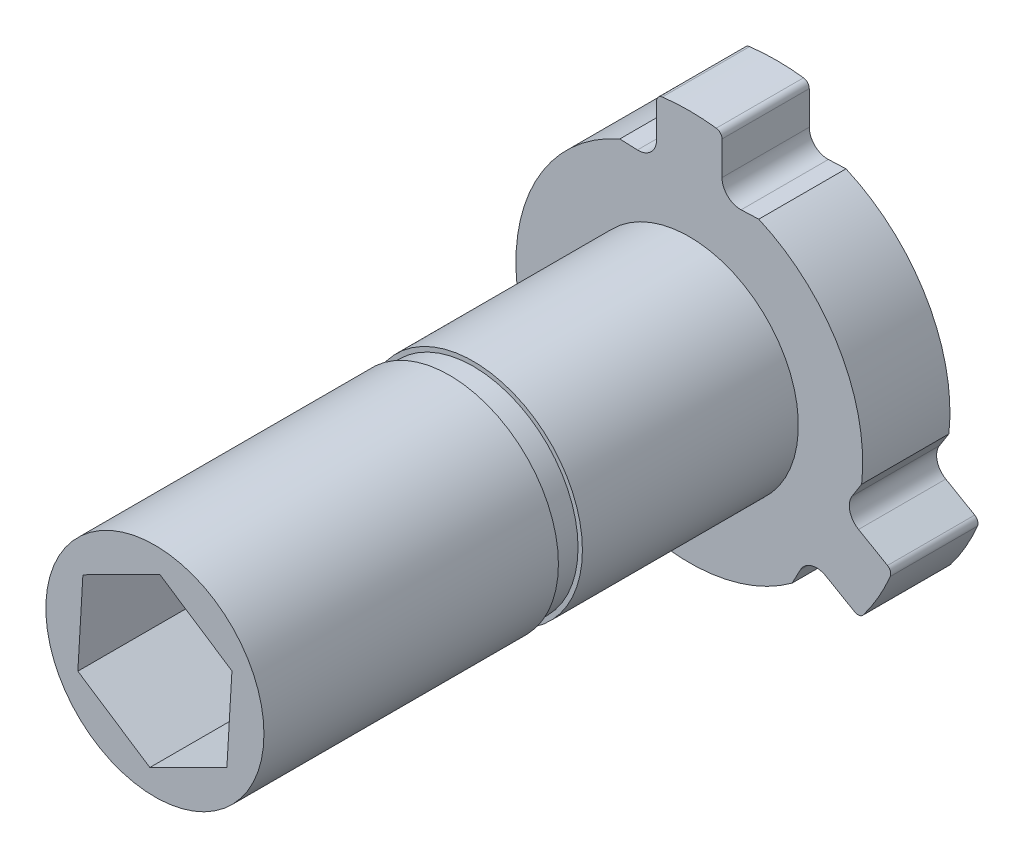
ISO-10303-21;
HEADER;
FILE_DESCRIPTION(('STEP AP214'),'2;1');
FILE_NAME('part.step','',(''),(''),'','','');
FILE_SCHEMA(('AUTOMOTIVE_DESIGN { 1 0 10303 214 1 1 1 1 }'));
ENDSEC;
DATA;
#1=APPLICATION_CONTEXT('core data for automotive mechanical design processes');
#2=APPLICATION_PROTOCOL_DEFINITION('international standard','automotive_design',2000,#1);
#3=PRODUCT_CONTEXT('',#1,'mechanical');
#4=PRODUCT('Part','Part','',(#3));
#5=PRODUCT_RELATED_PRODUCT_CATEGORY('part','',(#4));
#6=PRODUCT_DEFINITION_FORMATION('','',#4);
#7=PRODUCT_DEFINITION_CONTEXT('part definition',#1,'design');
#8=PRODUCT_DEFINITION('design','',#6,#7);
#9=PRODUCT_DEFINITION_SHAPE('','',#8);
#10=(LENGTH_UNIT() NAMED_UNIT(*) SI_UNIT(.MILLI.,.METRE.));
#11=(NAMED_UNIT(*) PLANE_ANGLE_UNIT() SI_UNIT($,.RADIAN.));
#12=(NAMED_UNIT(*) SI_UNIT($,.STERADIAN.) SOLID_ANGLE_UNIT());
#13=UNCERTAINTY_MEASURE_WITH_UNIT(LENGTH_MEASURE(1.E-05),#10,'distance_accuracy_value','');
#14=(GEOMETRIC_REPRESENTATION_CONTEXT(3) GLOBAL_UNCERTAINTY_ASSIGNED_CONTEXT((#13)) GLOBAL_UNIT_ASSIGNED_CONTEXT((#10,
#11,#12)) REPRESENTATION_CONTEXT('',''));
#15=CARTESIAN_POINT('',(0.,0.,0.));
#16=DIRECTION('',(0.,0.,1.));
#17=DIRECTION('',(1.,0.,0.));
#18=AXIS2_PLACEMENT_3D('',#15,#16,#17);
#19=CARTESIAN_POINT('',(0.,0.,24.5));
#20=DIRECTION('',(0.,0.,-1.));
#21=DIRECTION('',(-1.,0.,0.));
#22=AXIS2_PLACEMENT_3D('',#19,#20,#21);
#23=CYLINDRICAL_SURFACE('',#22,5.);
#24=CARTESIAN_POINT('',(0.,0.,0.));
#25=DIRECTION('',(0.,0.,-1.));
#26=DIRECTION('',(-1.,0.,0.));
#27=AXIS2_PLACEMENT_3D('',#24,#25,#26);
#28=CIRCLE('',#27,5.);
#29=CARTESIAN_POINT('',(-5.,0.,0.));
#30=VERTEX_POINT('',#29);
#31=EDGE_CURVE('E520',#30,#30,#28,.T.);
#32=ORIENTED_EDGE('',*,*,#31,.F.);
#33=EDGE_LOOP('',(#32));
#34=FACE_BOUND('',#33,.T.);
#35=CARTESIAN_POINT('',(0.,0.,9.9));
#36=DIRECTION('',(0.,0.,1.));
#37=DIRECTION('',(1.,0.,0.));
#38=AXIS2_PLACEMENT_3D('',#35,#36,#37);
#39=CIRCLE('',#38,5.);
#40=CARTESIAN_POINT('',(5.,0.,9.9));
#41=VERTEX_POINT('',#40);
#42=EDGE_CURVE('E715',#41,#41,#39,.T.);
#43=ORIENTED_EDGE('',*,*,#42,.F.);
#44=EDGE_LOOP('',(#43));
#45=FACE_BOUND('',#44,.T.);
#46=ADVANCED_FACE('F117',(#34,#45),#23,.T.);
#47=CARTESIAN_POINT('',(0.,0.,0.));
#48=DIRECTION('',(0.,0.,-1.));
#49=DIRECTION('',(-1.,0.,0.));
#50=AXIS2_PLACEMENT_3D('',#47,#48,#49);
#51=PLANE('',#50);
#52=ORIENTED_EDGE('',*,*,#31,.T.);
#53=EDGE_LOOP('',(#52));
#54=FACE_BOUND('',#53,.T.);
#55=CARTESIAN_POINT('',(0.,0.,0.));
#56=DIRECTION('',(0.,0.,-1.));
#57=DIRECTION('',(-1.,0.,0.));
#58=AXIS2_PLACEMENT_3D('',#55,#56,#57);
#59=CIRCLE('',#58,10.);
#60=CARTESIAN_POINT('',(9.21228481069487,-3.89021960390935,0.));
#61=VERTEX_POINT('',#60);
#62=CARTESIAN_POINT('',(7.97517140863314,-6.03296287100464,0.));
#63=VERTEX_POINT('',#62);
#64=EDGE_CURVE('E515',#61,#63,#59,.T.);
#65=ORIENTED_EDGE('',*,*,#64,.F.);
#66=CARTESIAN_POINT('',(8.93591626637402,-3.77351301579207,0.));
#67=DIRECTION('',(0.,0.,-1.));
#68=DIRECTION('',(-1.,0.,0.));
#69=AXIS2_PLACEMENT_3D('',#66,#67,#68);
#70=CIRCLE('',#69,0.3);
#71=CARTESIAN_POINT('',(9.08591626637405,-3.51370539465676,0.));
#72=VERTEX_POINT('',#71);
#73=EDGE_CURVE('E605',#61,#72,#70,.F.);
#74=ORIENTED_EDGE('',*,*,#73,.T.);
#75=DIRECTION('',(-0.866025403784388,0.500000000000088,0.));
#76=VECTOR('',#75,1.);
#77=CARTESIAN_POINT('',(0.750000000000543,1.29903810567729,0.));
#78=LINE('',#77,#76);
#79=CARTESIAN_POINT('',(7.75882819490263,-2.74751073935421,0.));
#80=VERTEX_POINT('',#79);
#81=EDGE_CURVE('E504',#72,#80,#78,.T.);
#82=ORIENTED_EDGE('',*,*,#81,.T.);
#83=CARTESIAN_POINT('',(8.18007630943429,-2.01788760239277,0.));
#84=DIRECTION('',(0.,0.,-1.));
#85=DIRECTION('',(-1.,0.,0.));
#86=AXIS2_PLACEMENT_3D('',#83,#84,#85);
#87=CIRCLE('',#86,0.842496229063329);
#88=CARTESIAN_POINT('',(7.46810034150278,-1.56745434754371,0.));
#89=VERTEX_POINT('',#88);
#90=EDGE_CURVE('E501',#80,#89,#87,.T.);
#91=ORIENTED_EDGE('',*,*,#90,.T.);
#92=DIRECTION('',(0.53464127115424,0.845079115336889,0.));
#93=VECTOR('',#92,1.);
#94=CARTESIAN_POINT('',(6.04160700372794,-3.8222367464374,0.));
#95=LINE('',#94,#93);
#96=CARTESIAN_POINT('',(7.90074398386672,-0.883597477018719,0.));
#97=VERTEX_POINT('',#96);
#98=EDGE_CURVE('E498',#89,#97,#95,.T.);
#99=ORIENTED_EDGE('',*,*,#98,.T.);
#100=CARTESIAN_POINT('',(0.,0.,0.));
#101=DIRECTION('',(0.,0.,-1.));
#102=DIRECTION('',(-1.,0.,0.));
#103=AXIS2_PLACEMENT_3D('',#100,#101,#102);
#104=CIRCLE('',#103,7.95);
#105=CARTESIAN_POINT('',(3.18515413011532,7.28404373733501,0.));
#106=VERTEX_POINT('',#105);
#107=EDGE_CURVE('E496',#106,#97,#104,.T.);
#108=ORIENTED_EDGE('',*,*,#107,.F.);
#109=DIRECTION('',(0.999180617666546,0.0404733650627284,0.));
#110=VECTOR('',#109,1.);
#111=CARTESIAN_POINT('',(-0.289350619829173,7.1433035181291,0.));
#112=LINE('',#111,#110);
#113=CARTESIAN_POINT('',(2.37659488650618,7.25129178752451,0.));
#114=VERTEX_POINT('',#113);
#115=EDGE_CURVE('E494',#114,#106,#112,.T.);
#116=ORIENTED_EDGE('',*,*,#115,.F.);
#117=CARTESIAN_POINT('',(2.34249622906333,8.09309769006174,0.));
#118=DIRECTION('',(0.,0.,-1.));
#119=DIRECTION('',(-1.,0.,0.));
#120=AXIS2_PLACEMENT_3D('',#117,#118,#119);
#121=CIRCLE('',#120,0.842496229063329);
#122=CARTESIAN_POINT('',(1.5,8.09309769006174,0.));
#123=VERTEX_POINT('',#122);
#124=EDGE_CURVE('E492',#123,#114,#121,.F.);
#125=ORIENTED_EDGE('',*,*,#124,.F.);
#126=DIRECTION('',(0.,-1.,0.));
#127=VECTOR('',#126,1.);
#128=CARTESIAN_POINT('',(1.5,0.,0.));
#129=LINE('',#128,#127);
#130=CARTESIAN_POINT('',(1.5,9.62548700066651,0.));
#131=VERTEX_POINT('',#130);
#132=EDGE_CURVE('E490',#131,#123,#129,.T.);
#133=ORIENTED_EDGE('',*,*,#132,.F.);
#134=CARTESIAN_POINT('',(1.2,9.62548700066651,0.));
#135=DIRECTION('',(0.,0.,-1.));
#136=DIRECTION('',(-1.,0.,0.));
#137=AXIS2_PLACEMENT_3D('',#134,#135,#136);
#138=CIRCLE('',#137,0.3);
#139=CARTESIAN_POINT('',(1.23711340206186,9.92318247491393,0.));
#140=VERTEX_POINT('',#139);
#141=EDGE_CURVE('E598',#131,#140,#138,.F.);
#142=ORIENTED_EDGE('',*,*,#141,.T.);
#143=CARTESIAN_POINT('',(-1.23711340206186,9.92318247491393,0.));
#144=VERTEX_POINT('',#143);
#145=EDGE_CURVE('E516',#144,#140,#59,.T.);
#146=ORIENTED_EDGE('',*,*,#145,.F.);
#147=CARTESIAN_POINT('',(-1.2,9.62548700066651,0.));
#148=DIRECTION('',(0.,0.,-1.));
#149=DIRECTION('',(-1.,0.,0.));
#150=AXIS2_PLACEMENT_3D('',#147,#148,#149);
#151=CIRCLE('',#150,0.3);
#152=CARTESIAN_POINT('',(-1.5,9.62548700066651,0.));
#153=VERTEX_POINT('',#152);
#154=EDGE_CURVE('E596',#144,#153,#151,.F.);
#155=ORIENTED_EDGE('',*,*,#154,.T.);
#156=DIRECTION('',(0.,-1.,0.));
#157=VECTOR('',#156,1.);
#158=CARTESIAN_POINT('',(-1.5,0.,0.));
#159=LINE('',#158,#157);
#160=CARTESIAN_POINT('',(-1.5,8.09309769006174,0.));
#161=VERTEX_POINT('',#160);
#162=EDGE_CURVE('E488',#153,#161,#159,.T.);
#163=ORIENTED_EDGE('',*,*,#162,.T.);
#164=CARTESIAN_POINT('',(-2.34249622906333,8.09309769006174,0.));
#165=DIRECTION('',(0.,0.,-1.));
#166=DIRECTION('',(-1.,0.,0.));
#167=AXIS2_PLACEMENT_3D('',#164,#165,#166);
#168=CIRCLE('',#167,0.842496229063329);
#169=CARTESIAN_POINT('',(-2.37659488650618,7.25129178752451,0.));
#170=VERTEX_POINT('',#169);
#171=EDGE_CURVE('E485',#161,#170,#168,.T.);
#172=ORIENTED_EDGE('',*,*,#171,.T.);
#173=DIRECTION('',(-0.999180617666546,0.0404733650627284,0.));
#174=VECTOR('',#173,1.);
#175=CARTESIAN_POINT('',(0.289350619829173,7.1433035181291,0.));
#176=LINE('',#175,#174);
#177=CARTESIAN_POINT('',(-3.18515413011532,7.28404373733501,0.));
#178=VERTEX_POINT('',#177);
#179=EDGE_CURVE('E482',#170,#178,#176,.T.);
#180=ORIENTED_EDGE('',*,*,#179,.T.);
#181=CARTESIAN_POINT('',(0.,0.,0.));
#182=DIRECTION('',(0.,0.,-1.));
#183=DIRECTION('',(-1.,0.,0.));
#184=AXIS2_PLACEMENT_3D('',#181,#182,#183);
#185=CIRCLE('',#184,7.95);
#186=CARTESIAN_POINT('',(-7.90074398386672,-0.883597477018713,0.));
#187=VERTEX_POINT('',#186);
#188=EDGE_CURVE('E480',#187,#178,#185,.T.);
#189=ORIENTED_EDGE('',*,*,#188,.F.);
#190=DIRECTION('',(-0.534641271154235,0.845079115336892,0.));
#191=VECTOR('',#190,1.);
#192=CARTESIAN_POINT('',(-6.04160700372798,-3.82223674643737,0.));
#193=LINE('',#192,#191);
#194=CARTESIAN_POINT('',(-7.46810034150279,-1.5674543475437,0.));
#195=VERTEX_POINT('',#194);
#196=EDGE_CURVE('E478',#195,#187,#193,.T.);
#197=ORIENTED_EDGE('',*,*,#196,.F.);
#198=CARTESIAN_POINT('',(-8.18007630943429,-2.01788760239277,0.));
#199=DIRECTION('',(0.,0.,-1.));
#200=DIRECTION('',(-1.,0.,0.));
#201=AXIS2_PLACEMENT_3D('',#198,#199,#200);
#202=CIRCLE('',#201,0.842496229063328);
#203=CARTESIAN_POINT('',(-7.75882819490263,-2.74751073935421,0.));
#204=VERTEX_POINT('',#203);
#205=EDGE_CURVE('E476',#204,#195,#202,.F.);
#206=ORIENTED_EDGE('',*,*,#205,.F.);
#207=DIRECTION('',(0.866025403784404,0.50000000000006,0.));
#208=VECTOR('',#207,1.);
#209=CARTESIAN_POINT('',(-0.750000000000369,1.29903810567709,0.));
#210=LINE('',#209,#208);
#211=CARTESIAN_POINT('',(-9.08591626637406,-3.51370539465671,0.));
#212=VERTEX_POINT('',#211);
#213=EDGE_CURVE('E474',#212,#204,#210,.T.);
#214=ORIENTED_EDGE('',*,*,#213,.F.);
#215=CARTESIAN_POINT('',(-8.93591626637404,-3.77351301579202,0.));
#216=DIRECTION('',(0.,0.,-1.));
#217=DIRECTION('',(-1.,0.,0.));
#218=AXIS2_PLACEMENT_3D('',#215,#216,#217);
#219=CIRCLE('',#218,0.3);
#220=CARTESIAN_POINT('',(-9.21228481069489,-3.8902196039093,0.));
#221=VERTEX_POINT('',#220);
#222=EDGE_CURVE('E603',#212,#221,#219,.F.);
#223=ORIENTED_EDGE('',*,*,#222,.T.);
#224=CARTESIAN_POINT('',(-7.97517140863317,-6.0329628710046,0.));
#225=VERTEX_POINT('',#224);
#226=EDGE_CURVE('E512',#225,#221,#59,.T.);
#227=ORIENTED_EDGE('',*,*,#226,.F.);
#228=CARTESIAN_POINT('',(-7.73591626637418,-5.85197398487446,0.));
#229=DIRECTION('',(0.,0.,-1.));
#230=DIRECTION('',(-1.,0.,0.));
#231=AXIS2_PLACEMENT_3D('',#228,#229,#230);
#232=CIRCLE('',#231,0.3);
#233=CARTESIAN_POINT('',(-7.58591626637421,-6.1117816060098,0.));
#234=VERTEX_POINT('',#233);
#235=EDGE_CURVE('E140',#225,#234,#232,.F.);
#236=ORIENTED_EDGE('',*,*,#235,.T.);
#237=DIRECTION('',(0.866025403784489,0.499999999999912,0.));
#238=VECTOR('',#237,1.);
#239=CARTESIAN_POINT('',(0.750000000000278,-1.29903810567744,0.));
#240=LINE('',#239,#238);
#241=CARTESIAN_POINT('',(-6.25882819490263,-5.34558695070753,0.));
#242=VERTEX_POINT('',#241);
#243=EDGE_CURVE('E472',#234,#242,#240,.T.);
#244=ORIENTED_EDGE('',*,*,#243,.T.);
#245=CARTESIAN_POINT('',(-5.83758008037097,-6.07521008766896,0.));
#246=DIRECTION('',(0.,0.,-1.));
#247=DIRECTION('',(-1.,0.,0.));
#248=AXIS2_PLACEMENT_3D('',#245,#246,#247);
#249=CIRCLE('',#248,0.842496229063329);
#250=CARTESIAN_POINT('',(-5.09150545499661,-5.68383743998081,0.));
#251=VERTEX_POINT('',#250);
#252=EDGE_CURVE('E470',#242,#251,#249,.T.);
#253=ORIENTED_EDGE('',*,*,#252,.T.);
#254=DIRECTION('',(0.464539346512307,-0.88555248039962,0.));
#255=VECTOR('',#254,1.);
#256=CARTESIAN_POINT('',(-6.33095762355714,-3.3210667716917,0.));
#257=LINE('',#256,#255);
#258=CARTESIAN_POINT('',(-4.71558985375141,-6.4004462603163,0.));
#259=VERTEX_POINT('',#258);
#260=EDGE_CURVE('E359',#251,#259,#257,.T.);
#261=ORIENTED_EDGE('',*,*,#260,.T.);
#262=CARTESIAN_POINT('',(0.,0.,0.));
#263=DIRECTION('',(0.,0.,-1.));
#264=DIRECTION('',(-1.,0.,0.));
#265=AXIS2_PLACEMENT_3D('',#262,#263,#264);
#266=CIRCLE('',#265,7.95);
#267=CARTESIAN_POINT('',(4.7155898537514,-6.40044626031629,0.));
#268=VERTEX_POINT('',#267);
#269=EDGE_CURVE('E433',#268,#259,#266,.T.);
#270=ORIENTED_EDGE('',*,*,#269,.F.);
#271=DIRECTION('',(-0.464539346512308,-0.885552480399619,0.));
#272=VECTOR('',#271,1.);
#273=CARTESIAN_POINT('',(6.33095762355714,-3.32106677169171,0.));
#274=LINE('',#273,#272);
#275=CARTESIAN_POINT('',(5.0915054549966,-5.68383743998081,0.));
#276=VERTEX_POINT('',#275);
#277=EDGE_CURVE('E510',#276,#268,#274,.T.);
#278=ORIENTED_EDGE('',*,*,#277,.F.);
#279=CARTESIAN_POINT('',(5.83758008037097,-6.07521008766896,0.));
#280=DIRECTION('',(0.,0.,-1.));
#281=DIRECTION('',(-1.,0.,0.));
#282=AXIS2_PLACEMENT_3D('',#279,#280,#281);
#283=CIRCLE('',#282,0.842496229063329);
#284=CARTESIAN_POINT('',(6.25882819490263,-5.34558695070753,0.));
#285=VERTEX_POINT('',#284);
#286=EDGE_CURVE('E508',#285,#276,#283,.F.);
#287=ORIENTED_EDGE('',*,*,#286,.F.);
#288=DIRECTION('',(-0.866025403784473,0.499999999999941,0.));
#289=VECTOR('',#288,1.);
#290=CARTESIAN_POINT('',(-0.750000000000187,-1.29903810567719,0.));
#291=LINE('',#290,#289);
#292=CARTESIAN_POINT('',(7.58591626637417,-6.11178160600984,0.));
#293=VERTEX_POINT('',#292);
#294=EDGE_CURVE('E506',#293,#285,#291,.T.);
#295=ORIENTED_EDGE('',*,*,#294,.F.);
#296=CARTESIAN_POINT('',(7.73591626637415,-5.8519739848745,0.));
#297=DIRECTION('',(0.,0.,-1.));
#298=DIRECTION('',(-1.,0.,0.));
#299=AXIS2_PLACEMENT_3D('',#296,#297,#298);
#300=CIRCLE('',#299,0.3);
#301=EDGE_CURVE('E600',#293,#63,#300,.F.);
#302=ORIENTED_EDGE('',*,*,#301,.T.);
#303=EDGE_LOOP('',(#65,#74,#82,#91,#99,#108,#116,#125,#133,#142,#146,#155,#163,#172,#180,#189,
#197,#206,#214,#223,#227,#236,#244,#253,#261,#270,#278,#287,#295,#302));
#304=FACE_BOUND('',#303,.T.);
#305=ADVANCED_FACE('F632',(#54,#304),#51,.F.);
#306=CARTESIAN_POINT('',(0.,0.,-4.));
#307=DIRECTION('',(0.,0.,1.));
#308=DIRECTION('',(1.,0.,0.));
#309=AXIS2_PLACEMENT_3D('',#306,#307,#308);
#310=CYLINDRICAL_SURFACE('',#309,10.);
#311=CARTESIAN_POINT('',(0.,0.,-4.));
#312=DIRECTION('',(0.,0.,-1.));
#313=DIRECTION('',(-1.,0.,0.));
#314=AXIS2_PLACEMENT_3D('',#311,#312,#313);
#315=CIRCLE('',#314,10.);
#316=CARTESIAN_POINT('',(9.21228481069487,-3.89021960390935,-4.));
#317=VERTEX_POINT('',#316);
#318=CARTESIAN_POINT('',(7.97517140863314,-6.03296287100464,-4.));
#319=VERTEX_POINT('',#318);
#320=EDGE_CURVE('E521',#317,#319,#315,.T.);
#321=ORIENTED_EDGE('',*,*,#320,.F.);
#322=DIRECTION('',(0.,0.,1.));
#323=VECTOR('',#322,1.);
#324=CARTESIAN_POINT('',(9.21228481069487,-3.89021960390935,-4.));
#325=LINE('',#324,#323);
#326=EDGE_CURVE('E594',#317,#61,#325,.T.);
#327=ORIENTED_EDGE('',*,*,#326,.T.);
#328=ORIENTED_EDGE('',*,*,#64,.T.);
#329=DIRECTION('',(0.,0.,1.));
#330=VECTOR('',#329,1.);
#331=CARTESIAN_POINT('',(7.97517140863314,-6.03296287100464,-4.));
#332=LINE('',#331,#330);
#333=EDGE_CURVE('E591',#63,#319,#332,.F.);
#334=ORIENTED_EDGE('',*,*,#333,.T.);
#335=EDGE_LOOP('',(#321,#327,#328,#334));
#336=FACE_BOUND('',#335,.T.);
#337=ADVANCED_FACE('F693',(#336),#310,.T.);
#338=ORIENTED_EDGE('',*,*,#145,.T.);
#339=DIRECTION('',(0.,0.,1.));
#340=VECTOR('',#339,1.);
#341=CARTESIAN_POINT('',(1.23711340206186,9.92318247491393,-4.));
#342=LINE('',#341,#340);
#343=CARTESIAN_POINT('',(1.23711340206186,9.92318247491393,-4.));
#344=VERTEX_POINT('',#343);
#345=EDGE_CURVE('E620',#140,#344,#342,.F.);
#346=ORIENTED_EDGE('',*,*,#345,.T.);
#347=CARTESIAN_POINT('',(-1.23711340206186,9.92318247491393,-4.));
#348=VERTEX_POINT('',#347);
#349=EDGE_CURVE('E517',#348,#344,#315,.T.);
#350=ORIENTED_EDGE('',*,*,#349,.F.);
#351=DIRECTION('',(0.,0.,1.));
#352=VECTOR('',#351,1.);
#353=CARTESIAN_POINT('',(-1.23711340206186,9.92318247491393,-4.));
#354=LINE('',#353,#352);
#355=EDGE_CURVE('E618',#348,#144,#354,.T.);
#356=ORIENTED_EDGE('',*,*,#355,.T.);
#357=EDGE_LOOP('',(#338,#346,#350,#356));
#358=FACE_BOUND('',#357,.T.);
#359=ADVANCED_FACE('F640',(#358),#310,.T.);
#360=ORIENTED_EDGE('',*,*,#226,.T.);
#361=DIRECTION('',(0.,0.,1.));
#362=VECTOR('',#361,1.);
#363=CARTESIAN_POINT('',(-9.21228481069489,-3.8902196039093,-4.));
#364=LINE('',#363,#362);
#365=CARTESIAN_POINT('',(-9.21228481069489,-3.8902196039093,-4.));
#366=VERTEX_POINT('',#365);
#367=EDGE_CURVE('E609',#221,#366,#364,.F.);
#368=ORIENTED_EDGE('',*,*,#367,.T.);
#369=CARTESIAN_POINT('',(-7.97517140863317,-6.0329628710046,-4.));
#370=VERTEX_POINT('',#369);
#371=EDGE_CURVE('E522',#370,#366,#315,.T.);
#372=ORIENTED_EDGE('',*,*,#371,.F.);
#373=DIRECTION('',(0.,0.,1.));
#374=VECTOR('',#373,1.);
#375=CARTESIAN_POINT('',(-7.97517140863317,-6.0329628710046,-4.));
#376=LINE('',#375,#374);
#377=EDGE_CURVE('E607',#370,#225,#376,.T.);
#378=ORIENTED_EDGE('',*,*,#377,.T.);
#379=EDGE_LOOP('',(#360,#368,#372,#378));
#380=FACE_BOUND('',#379,.T.);
#381=ADVANCED_FACE('F685',(#380),#310,.T.);
#382=CARTESIAN_POINT('',(0.,0.,-4.));
#383=DIRECTION('',(0.,0.,-1.));
#384=DIRECTION('',(-1.,0.,0.));
#385=AXIS2_PLACEMENT_3D('',#382,#383,#384);
#386=PLANE('',#385);
#387=CARTESIAN_POINT('',(0.,0.,-4.));
#388=DIRECTION('',(0.,0.,-1.));
#389=DIRECTION('',(-1.,0.,0.));
#390=AXIS2_PLACEMENT_3D('',#387,#388,#389);
#391=CIRCLE('',#390,0.545651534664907);
#392=CARTESIAN_POINT('',(-0.545651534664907,0.,-4.));
#393=VERTEX_POINT('',#392);
#394=EDGE_CURVE('E710',#393,#393,#391,.T.);
#395=ORIENTED_EDGE('',*,*,#394,.F.);
#396=EDGE_LOOP('',(#395));
#397=FACE_BOUND('',#396,.T.);
#398=DIRECTION('',(-0.866025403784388,0.500000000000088,0.));
#399=VECTOR('',#398,1.);
#400=CARTESIAN_POINT('',(-15.8560660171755,10.8865547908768,-4.));
#401=LINE('',#400,#399);
#402=CARTESIAN_POINT('',(9.08591626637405,-3.51370539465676,-4.));
#403=VERTEX_POINT('',#402);
#404=CARTESIAN_POINT('',(7.75882819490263,-2.74751073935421,-4.));
#405=VERTEX_POINT('',#404);
#406=EDGE_CURVE('E423',#403,#405,#401,.T.);
#407=ORIENTED_EDGE('',*,*,#406,.F.);
#408=CARTESIAN_POINT('',(8.93591626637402,-3.77351301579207,-4.));
#409=DIRECTION('',(0.,0.,-1.));
#410=DIRECTION('',(-1.,0.,0.));
#411=AXIS2_PLACEMENT_3D('',#408,#409,#410);
#412=CIRCLE('',#411,0.3);
#413=EDGE_CURVE('E589',#403,#317,#412,.T.);
#414=ORIENTED_EDGE('',*,*,#413,.T.);
#415=ORIENTED_EDGE('',*,*,#320,.T.);
#416=CARTESIAN_POINT('',(7.73591626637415,-5.8519739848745,-4.));
#417=DIRECTION('',(0.,0.,-1.));
#418=DIRECTION('',(-1.,0.,0.));
#419=AXIS2_PLACEMENT_3D('',#416,#417,#418);
#420=CIRCLE('',#419,0.3);
#421=CARTESIAN_POINT('',(7.58591626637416,-6.11178160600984,-4.));
#422=VERTEX_POINT('',#421);
#423=EDGE_CURVE('E583',#319,#422,#420,.T.);
#424=ORIENTED_EDGE('',*,*,#423,.T.);
#425=DIRECTION('',(-0.866025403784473,0.499999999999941,0.));
#426=VECTOR('',#425,1.);
#427=CARTESIAN_POINT('',(-17.3560660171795,8.28847857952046,-4.));
#428=LINE('',#427,#426);
#429=CARTESIAN_POINT('',(6.25882819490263,-5.34558695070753,-4.));
#430=VERTEX_POINT('',#429);
#431=EDGE_CURVE('E425',#422,#430,#428,.T.);
#432=ORIENTED_EDGE('',*,*,#431,.T.);
#433=CARTESIAN_POINT('',(5.83758008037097,-6.07521008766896,-4.));
#434=DIRECTION('',(0.,0.,-1.));
#435=DIRECTION('',(-1.,0.,0.));
#436=AXIS2_PLACEMENT_3D('',#433,#434,#435);
#437=CIRCLE('',#436,0.842496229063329);
#438=CARTESIAN_POINT('',(5.0915054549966,-5.68383743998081,-4.));
#439=VERTEX_POINT('',#438);
#440=EDGE_CURVE('E427',#430,#439,#437,.F.);
#441=ORIENTED_EDGE('',*,*,#440,.T.);
#442=DIRECTION('',(-0.464539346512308,-0.885552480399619,0.));
#443=VECTOR('',#442,1.);
#444=CARTESIAN_POINT('',(1.55290964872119,-12.4294711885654,-4.));
#445=LINE('',#444,#443);
#446=CARTESIAN_POINT('',(4.7155898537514,-6.4004462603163,-4.));
#447=VERTEX_POINT('',#446);
#448=EDGE_CURVE('E382',#439,#447,#445,.T.);
#449=ORIENTED_EDGE('',*,*,#448,.T.);
#450=CARTESIAN_POINT('',(0.,0.,-4.));
#451=DIRECTION('',(0.,0.,-1.));
#452=DIRECTION('',(-1.,0.,0.));
#453=AXIS2_PLACEMENT_3D('',#450,#451,#452);
#454=CIRCLE('',#453,7.95);
#455=CARTESIAN_POINT('',(-4.71558985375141,-6.40044626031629,-4.));
#456=VERTEX_POINT('',#455);
#457=EDGE_CURVE('E380',#447,#456,#454,.T.);
#458=ORIENTED_EDGE('',*,*,#457,.T.);
#459=DIRECTION('',(0.464539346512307,-0.88555248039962,0.));
#460=VECTOR('',#459,1.);
#461=CARTESIAN_POINT('',(-11.1090055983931,5.78733764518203,-4.));
#462=LINE('',#461,#460);
#463=CARTESIAN_POINT('',(-5.09150545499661,-5.68383743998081,-4.));
#464=VERTEX_POINT('',#463);
#465=EDGE_CURVE('E356',#464,#456,#462,.T.);
#466=ORIENTED_EDGE('',*,*,#465,.F.);
#467=CARTESIAN_POINT('',(-5.83758008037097,-6.07521008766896,-4.));
#468=DIRECTION('',(0.,0.,-1.));
#469=DIRECTION('',(-1.,0.,0.));
#470=AXIS2_PLACEMENT_3D('',#467,#468,#469);
#471=CIRCLE('',#470,0.842496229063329);
#472=CARTESIAN_POINT('',(-6.25882819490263,-5.34558695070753,-4.));
#473=VERTEX_POINT('',#472);
#474=EDGE_CURVE('E368',#473,#464,#471,.T.);
#475=ORIENTED_EDGE('',*,*,#474,.F.);
#476=DIRECTION('',(0.866025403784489,0.499999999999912,0.));
#477=VECTOR('',#476,1.);
#478=CARTESIAN_POINT('',(-15.8560660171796,-10.8865547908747,-4.));
#479=LINE('',#478,#477);
#480=CARTESIAN_POINT('',(-7.5859162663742,-6.1117816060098,-4.));
#481=VERTEX_POINT('',#480);
#482=EDGE_CURVE('E373',#481,#473,#479,.T.);
#483=ORIENTED_EDGE('',*,*,#482,.F.);
#484=CARTESIAN_POINT('',(-7.73591626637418,-5.85197398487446,-4.));
#485=DIRECTION('',(0.,0.,-1.));
#486=DIRECTION('',(-1.,0.,0.));
#487=AXIS2_PLACEMENT_3D('',#484,#485,#486);
#488=CIRCLE('',#487,0.3);
#489=EDGE_CURVE('E585',#481,#370,#488,.T.);
#490=ORIENTED_EDGE('',*,*,#489,.T.);
#491=ORIENTED_EDGE('',*,*,#371,.T.);
#492=CARTESIAN_POINT('',(-8.93591626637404,-3.77351301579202,-4.));
#493=DIRECTION('',(0.,0.,-1.));
#494=DIRECTION('',(-1.,0.,0.));
#495=AXIS2_PLACEMENT_3D('',#492,#493,#494);
#496=CIRCLE('',#495,0.3);
#497=CARTESIAN_POINT('',(-9.08591626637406,-3.5137053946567,-4.));
#498=VERTEX_POINT('',#497);
#499=EDGE_CURVE('E587',#366,#498,#496,.T.);
#500=ORIENTED_EDGE('',*,*,#499,.T.);
#501=DIRECTION('',(0.866025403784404,0.50000000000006,0.));
#502=VECTOR('',#501,1.);
#503=CARTESIAN_POINT('',(-17.356066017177,-8.28847857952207,-4.));
#504=LINE('',#503,#502);
#505=CARTESIAN_POINT('',(-7.75882819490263,-2.74751073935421,-4.));
#506=VERTEX_POINT('',#505);
#507=EDGE_CURVE('E387',#498,#506,#504,.T.);
#508=ORIENTED_EDGE('',*,*,#507,.T.);
#509=CARTESIAN_POINT('',(-8.18007630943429,-2.01788760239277,-4.));
#510=DIRECTION('',(0.,0.,-1.));
#511=DIRECTION('',(-1.,0.,0.));
#512=AXIS2_PLACEMENT_3D('',#509,#510,#511);
#513=CIRCLE('',#512,0.842496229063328);
#514=CARTESIAN_POINT('',(-7.46810034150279,-1.5674543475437,-4.));
#515=VERTEX_POINT('',#514);
#516=EDGE_CURVE('E389',#506,#515,#513,.F.);
#517=ORIENTED_EDGE('',*,*,#516,.T.);
#518=DIRECTION('',(-0.534641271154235,0.845079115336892,0.));
#519=VECTOR('',#518,1.);
#520=CARTESIAN_POINT('',(-12.3705394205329,6.18157122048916,-4.));
#521=LINE('',#520,#519);
#522=CARTESIAN_POINT('',(-7.90074398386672,-0.883597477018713,-4.));
#523=VERTEX_POINT('',#522);
#524=EDGE_CURVE('E392',#515,#523,#521,.T.);
#525=ORIENTED_EDGE('',*,*,#524,.T.);
#526=CARTESIAN_POINT('',(0.,0.,-4.));
#527=DIRECTION('',(0.,0.,-1.));
#528=DIRECTION('',(-1.,0.,0.));
#529=AXIS2_PLACEMENT_3D('',#526,#527,#528);
#530=CIRCLE('',#529,7.95);
#531=CARTESIAN_POINT('',(-3.18515413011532,7.28404373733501,-4.));
#532=VERTEX_POINT('',#531);
#533=EDGE_CURVE('E395',#523,#532,#530,.T.);
#534=ORIENTED_EDGE('',*,*,#533,.T.);
#535=DIRECTION('',(-0.999180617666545,0.0404733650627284,0.));
#536=VECTOR('',#535,1.);
#537=CARTESIAN_POINT('',(-21.8158010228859,8.0387070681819,-4.));
#538=LINE('',#537,#536);
#539=CARTESIAN_POINT('',(-2.37659488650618,7.25129178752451,-4.));
#540=VERTEX_POINT('',#539);
#541=EDGE_CURVE('E398',#540,#532,#538,.T.);
#542=ORIENTED_EDGE('',*,*,#541,.F.);
#543=CARTESIAN_POINT('',(-2.34249622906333,8.09309769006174,-4.));
#544=DIRECTION('',(0.,0.,-1.));
#545=DIRECTION('',(-1.,0.,0.));
#546=AXIS2_PLACEMENT_3D('',#543,#544,#545);
#547=CIRCLE('',#546,0.842496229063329);
#548=CARTESIAN_POINT('',(-1.5,8.09309769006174,-4.));
#549=VERTEX_POINT('',#548);
#550=EDGE_CURVE('E401',#549,#540,#547,.T.);
#551=ORIENTED_EDGE('',*,*,#550,.F.);
#552=DIRECTION('',(0.,-1.,0.));
#553=VECTOR('',#552,1.);
#554=CARTESIAN_POINT('',(-1.5,0.,-4.));
#555=LINE('',#554,#553);
#556=CARTESIAN_POINT('',(-1.5,9.62548700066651,-4.));
#557=VERTEX_POINT('',#556);
#558=EDGE_CURVE('E404',#557,#549,#555,.T.);
#559=ORIENTED_EDGE('',*,*,#558,.F.);
#560=CARTESIAN_POINT('',(-1.2,9.62548700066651,-4.));
#561=DIRECTION('',(0.,0.,-1.));
#562=DIRECTION('',(-1.,0.,0.));
#563=AXIS2_PLACEMENT_3D('',#560,#561,#562);
#564=CIRCLE('',#563,0.3);
#565=EDGE_CURVE('E579',#557,#348,#564,.T.);
#566=ORIENTED_EDGE('',*,*,#565,.T.);
#567=ORIENTED_EDGE('',*,*,#349,.T.);
#568=CARTESIAN_POINT('',(1.2,9.62548700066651,-4.));
#569=DIRECTION('',(0.,0.,-1.));
#570=DIRECTION('',(-1.,0.,0.));
#571=AXIS2_PLACEMENT_3D('',#568,#569,#570);
#572=CIRCLE('',#571,0.3);
#573=CARTESIAN_POINT('',(1.5,9.62548700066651,-4.));
#574=VERTEX_POINT('',#573);
#575=EDGE_CURVE('E581',#344,#574,#572,.T.);
#576=ORIENTED_EDGE('',*,*,#575,.T.);
#577=DIRECTION('',(0.,-1.,0.));
#578=VECTOR('',#577,1.);
#579=CARTESIAN_POINT('',(1.5,0.,-4.));
#580=LINE('',#579,#578);
#581=CARTESIAN_POINT('',(1.5,8.09309769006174,-4.));
#582=VERTEX_POINT('',#581);
#583=EDGE_CURVE('E406',#574,#582,#580,.T.);
#584=ORIENTED_EDGE('',*,*,#583,.T.);
#585=CARTESIAN_POINT('',(2.34249622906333,8.09309769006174,-4.));
#586=DIRECTION('',(0.,0.,-1.));
#587=DIRECTION('',(-1.,0.,0.));
#588=AXIS2_PLACEMENT_3D('',#585,#586,#587);
#589=CIRCLE('',#588,0.842496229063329);
#590=CARTESIAN_POINT('',(2.37659488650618,7.25129178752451,-4.));
#591=VERTEX_POINT('',#590);
#592=EDGE_CURVE('E408',#582,#591,#589,.F.);
#593=ORIENTED_EDGE('',*,*,#592,.T.);
#594=DIRECTION('',(0.999180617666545,0.0404733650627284,0.));
#595=VECTOR('',#594,1.);
#596=CARTESIAN_POINT('',(-22.3945022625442,6.2478999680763,-4.));
#597=LINE('',#596,#595);
#598=CARTESIAN_POINT('',(3.18515413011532,7.28404373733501,-4.));
#599=VERTEX_POINT('',#598);
#600=EDGE_CURVE('E411',#591,#599,#597,.T.);
#601=ORIENTED_EDGE('',*,*,#600,.T.);
#602=CARTESIAN_POINT('',(0.,0.,-4.));
#603=DIRECTION('',(0.,0.,-1.));
#604=DIRECTION('',(-1.,0.,0.));
#605=AXIS2_PLACEMENT_3D('',#602,#603,#604);
#606=CIRCLE('',#605,7.95);
#607=CARTESIAN_POINT('',(7.90074398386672,-0.883597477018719,-4.));
#608=VERTEX_POINT('',#607);
#609=EDGE_CURVE('E414',#599,#608,#606,.T.);
#610=ORIENTED_EDGE('',*,*,#609,.T.);
#611=DIRECTION('',(0.53464127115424,0.845079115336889,0.));
#612=VECTOR('',#611,1.);
#613=CARTESIAN_POINT('',(-0.287325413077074,-13.826044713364,-4.));
#614=LINE('',#613,#612);
#615=CARTESIAN_POINT('',(7.46810034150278,-1.56745434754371,-4.));
#616=VERTEX_POINT('',#615);
#617=EDGE_CURVE('E417',#616,#608,#614,.T.);
#618=ORIENTED_EDGE('',*,*,#617,.F.);
#619=CARTESIAN_POINT('',(8.18007630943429,-2.01788760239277,-4.));
#620=DIRECTION('',(0.,0.,-1.));
#621=DIRECTION('',(-1.,0.,0.));
#622=AXIS2_PLACEMENT_3D('',#619,#620,#621);
#623=CIRCLE('',#622,0.842496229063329);
#624=EDGE_CURVE('E420',#405,#616,#623,.T.);
#625=ORIENTED_EDGE('',*,*,#624,.F.);
#626=EDGE_LOOP('',(#407,#414,#415,#424,#432,#441,#449,#458,#466,#475,#483,#490,#491,#500,#508,
#517,#525,#534,#542,#551,#559,#566,#567,#576,#584,#593,#601,#610,#618,#625));
#627=FACE_BOUND('',#626,.T.);
#628=ADVANCED_FACE('F377',(#397,#627),#386,.T.);
#629=CARTESIAN_POINT('',(0.,0.,24.5));
#630=DIRECTION('',(0.,0.,-1.));
#631=DIRECTION('',(-1.,0.,0.));
#632=AXIS2_PLACEMENT_3D('',#629,#630,#631);
#633=CYLINDRICAL_SURFACE('',#632,7.95);
#634=ORIENTED_EDGE('',*,*,#269,.T.);
#635=DIRECTION('',(0.,0.,-1.));
#636=VECTOR('',#635,1.);
#637=CARTESIAN_POINT('',(-4.71558985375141,-6.4004462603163,24.5));
#638=LINE('',#637,#636);
#639=EDGE_CURVE('E364',#259,#456,#638,.T.);
#640=ORIENTED_EDGE('',*,*,#639,.T.);
#641=ORIENTED_EDGE('',*,*,#457,.F.);
#642=DIRECTION('',(0.,0.,-1.));
#643=VECTOR('',#642,1.);
#644=CARTESIAN_POINT('',(4.7155898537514,-6.40044626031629,24.5));
#645=LINE('',#644,#643);
#646=EDGE_CURVE('E430',#268,#447,#645,.T.);
#647=ORIENTED_EDGE('',*,*,#646,.F.);
#648=EDGE_LOOP('',(#634,#640,#641,#647));
#649=FACE_BOUND('',#648,.T.);
#650=ADVANCED_FACE('F795',(#649),#633,.T.);
#651=CARTESIAN_POINT('',(-11.1090055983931,5.78733764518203,24.5));
#652=DIRECTION('',(0.88555248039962,0.464539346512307,0.));
#653=DIRECTION('',(-0.464539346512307,0.88555248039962,0.));
#654=AXIS2_PLACEMENT_3D('',#651,#652,#653);
#655=PLANE('',#654);
#656=DIRECTION('',(0.,0.,-1.));
#657=VECTOR('',#656,1.);
#658=CARTESIAN_POINT('',(-5.09150545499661,-5.68383743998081,24.5));
#659=LINE('',#658,#657);
#660=EDGE_CURVE('E351',#251,#464,#659,.T.);
#661=ORIENTED_EDGE('',*,*,#660,.T.);
#662=ORIENTED_EDGE('',*,*,#465,.T.);
#663=ORIENTED_EDGE('',*,*,#639,.F.);
#664=ORIENTED_EDGE('',*,*,#260,.F.);
#665=EDGE_LOOP('',(#661,#662,#663,#664));
#666=FACE_BOUND('',#665,.T.);
#667=ADVANCED_FACE('F353',(#666),#655,.F.);
#668=CARTESIAN_POINT('',(-5.83758008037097,-6.07521008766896,24.5));
#669=DIRECTION('',(0.,0.,-1.));
#670=DIRECTION('',(-1.,0.,0.));
#671=AXIS2_PLACEMENT_3D('',#668,#669,#670);
#672=CYLINDRICAL_SURFACE('',#671,0.842496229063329);
#673=DIRECTION('',(0.,0.,-1.));
#674=VECTOR('',#673,1.);
#675=CARTESIAN_POINT('',(-6.25882819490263,-5.34558695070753,24.5));
#676=LINE('',#675,#674);
#677=EDGE_CURVE('E363',#242,#473,#676,.T.);
#678=ORIENTED_EDGE('',*,*,#677,.T.);
#679=ORIENTED_EDGE('',*,*,#474,.T.);
#680=ORIENTED_EDGE('',*,*,#660,.F.);
#681=ORIENTED_EDGE('',*,*,#252,.F.);
#682=EDGE_LOOP('',(#678,#679,#680,#681));
#683=FACE_BOUND('',#682,.T.);
#684=ADVANCED_FACE('F369',(#683),#672,.F.);
#685=CARTESIAN_POINT('',(-15.8560660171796,-10.8865547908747,24.5));
#686=DIRECTION('',(-0.499999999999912,0.866025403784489,0.));
#687=DIRECTION('',(-0.866025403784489,-0.499999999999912,0.));
#688=AXIS2_PLACEMENT_3D('',#685,#686,#687);
#689=PLANE('',#688);
#690=ORIENTED_EDGE('',*,*,#243,.F.);
#691=DIRECTION('',(0.,0.,1.));
#692=VECTOR('',#691,1.);
#693=CARTESIAN_POINT('',(-7.5859162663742,-6.1117816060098,24.5));
#694=LINE('',#693,#692);
#695=EDGE_CURVE('E614',#234,#481,#694,.F.);
#696=ORIENTED_EDGE('',*,*,#695,.T.);
#697=ORIENTED_EDGE('',*,*,#482,.T.);
#698=ORIENTED_EDGE('',*,*,#677,.F.);
#699=EDGE_LOOP('',(#690,#696,#697,#698));
#700=FACE_BOUND('',#699,.T.);
#701=ADVANCED_FACE('F809',(#700),#689,.F.);
#702=CARTESIAN_POINT('',(-17.3560660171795,8.28847857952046,24.5));
#703=DIRECTION('',(-0.499999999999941,-0.866025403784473,0.));
#704=DIRECTION('',(0.866025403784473,-0.499999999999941,0.));
#705=AXIS2_PLACEMENT_3D('',#702,#703,#704);
#706=PLANE('',#705);
#707=ORIENTED_EDGE('',*,*,#431,.F.);
#708=DIRECTION('',(0.,0.,-1.));
#709=VECTOR('',#708,1.);
#710=CARTESIAN_POINT('',(7.58591626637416,-6.11178160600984,0.));
#711=LINE('',#710,#709);
#712=EDGE_CURVE('E132',#422,#293,#711,.F.);
#713=ORIENTED_EDGE('',*,*,#712,.T.);
#714=ORIENTED_EDGE('',*,*,#294,.T.);
#715=DIRECTION('',(0.,0.,-1.));
#716=VECTOR('',#715,1.);
#717=CARTESIAN_POINT('',(6.25882819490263,-5.34558695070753,24.5));
#718=LINE('',#717,#716);
#719=EDGE_CURVE('E434',#285,#430,#718,.T.);
#720=ORIENTED_EDGE('',*,*,#719,.T.);
#721=EDGE_LOOP('',(#707,#713,#714,#720));
#722=FACE_BOUND('',#721,.T.);
#723=ADVANCED_FACE('F699',(#722),#706,.T.);
#724=CARTESIAN_POINT('',(5.83758008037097,-6.07521008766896,24.5));
#725=DIRECTION('',(0.,0.,-1.));
#726=DIRECTION('',(-1.,0.,0.));
#727=AXIS2_PLACEMENT_3D('',#724,#725,#726);
#728=CYLINDRICAL_SURFACE('',#727,0.842496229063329);
#729=ORIENTED_EDGE('',*,*,#286,.T.);
#730=DIRECTION('',(0.,0.,-1.));
#731=VECTOR('',#730,1.);
#732=CARTESIAN_POINT('',(5.0915054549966,-5.68383743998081,24.5));
#733=LINE('',#732,#731);
#734=EDGE_CURVE('E431',#276,#439,#733,.T.);
#735=ORIENTED_EDGE('',*,*,#734,.T.);
#736=ORIENTED_EDGE('',*,*,#440,.F.);
#737=ORIENTED_EDGE('',*,*,#719,.F.);
#738=EDGE_LOOP('',(#729,#735,#736,#737));
#739=FACE_BOUND('',#738,.T.);
#740=ADVANCED_FACE('F704',(#739),#728,.F.);
#741=CARTESIAN_POINT('',(1.55290964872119,-12.4294711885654,24.5));
#742=DIRECTION('',(0.885552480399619,-0.464539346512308,0.));
#743=DIRECTION('',(0.464539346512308,0.885552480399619,0.));
#744=AXIS2_PLACEMENT_3D('',#741,#742,#743);
#745=PLANE('',#744);
#746=ORIENTED_EDGE('',*,*,#277,.T.);
#747=ORIENTED_EDGE('',*,*,#646,.T.);
#748=ORIENTED_EDGE('',*,*,#448,.F.);
#749=ORIENTED_EDGE('',*,*,#734,.F.);
#750=EDGE_LOOP('',(#746,#747,#748,#749));
#751=FACE_BOUND('',#750,.T.);
#752=ADVANCED_FACE('F798',(#751),#745,.T.);
#753=CARTESIAN_POINT('',(-17.356066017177,-8.28847857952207,24.5));
#754=DIRECTION('',(-0.50000000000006,0.866025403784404,0.));
#755=DIRECTION('',(-0.866025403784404,-0.50000000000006,0.));
#756=AXIS2_PLACEMENT_3D('',#753,#754,#755);
#757=PLANE('',#756);
#758=ORIENTED_EDGE('',*,*,#507,.F.);
#759=DIRECTION('',(0.,0.,-1.));
#760=VECTOR('',#759,1.);
#761=CARTESIAN_POINT('',(-9.08591626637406,-3.5137053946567,0.));
#762=LINE('',#761,#760);
#763=EDGE_CURVE('E612',#498,#212,#762,.F.);
#764=ORIENTED_EDGE('',*,*,#763,.T.);
#765=ORIENTED_EDGE('',*,*,#213,.T.);
#766=DIRECTION('',(0.,0.,-1.));
#767=VECTOR('',#766,1.);
#768=CARTESIAN_POINT('',(-7.75882819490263,-2.74751073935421,24.5));
#769=LINE('',#768,#767);
#770=EDGE_CURVE('E462',#204,#506,#769,.T.);
#771=ORIENTED_EDGE('',*,*,#770,.T.);
#772=EDGE_LOOP('',(#758,#764,#765,#771));
#773=FACE_BOUND('',#772,.T.);
#774=ADVANCED_FACE('F801',(#773),#757,.T.);
#775=CARTESIAN_POINT('',(-8.18007630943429,-2.01788760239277,24.5));
#776=DIRECTION('',(0.,0.,-1.));
#777=DIRECTION('',(-1.,0.,0.));
#778=AXIS2_PLACEMENT_3D('',#775,#776,#777);
#779=CYLINDRICAL_SURFACE('',#778,0.842496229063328);
#780=ORIENTED_EDGE('',*,*,#205,.T.);
#781=DIRECTION('',(0.,0.,-1.));
#782=VECTOR('',#781,1.);
#783=CARTESIAN_POINT('',(-7.46810034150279,-1.5674543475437,24.5));
#784=LINE('',#783,#782);
#785=EDGE_CURVE('E460',#195,#515,#784,.T.);
#786=ORIENTED_EDGE('',*,*,#785,.T.);
#787=ORIENTED_EDGE('',*,*,#516,.F.);
#788=ORIENTED_EDGE('',*,*,#770,.F.);
#789=EDGE_LOOP('',(#780,#786,#787,#788));
#790=FACE_BOUND('',#789,.T.);
#791=ADVANCED_FACE('F673',(#790),#779,.F.);
#792=CARTESIAN_POINT('',(-12.3705394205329,6.18157122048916,24.5));
#793=DIRECTION('',(-0.845079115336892,-0.534641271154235,0.));
#794=DIRECTION('',(0.534641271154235,-0.845079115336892,0.));
#795=AXIS2_PLACEMENT_3D('',#792,#793,#794);
#796=PLANE('',#795);
#797=ORIENTED_EDGE('',*,*,#196,.T.);
#798=DIRECTION('',(0.,0.,-1.));
#799=VECTOR('',#798,1.);
#800=CARTESIAN_POINT('',(-7.90074398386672,-0.883597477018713,24.5));
#801=LINE('',#800,#799);
#802=EDGE_CURVE('E458',#187,#523,#801,.T.);
#803=ORIENTED_EDGE('',*,*,#802,.T.);
#804=ORIENTED_EDGE('',*,*,#524,.F.);
#805=ORIENTED_EDGE('',*,*,#785,.F.);
#806=EDGE_LOOP('',(#797,#803,#804,#805));
#807=FACE_BOUND('',#806,.T.);
#808=ADVANCED_FACE('F669',(#807),#796,.T.);
#809=CARTESIAN_POINT('',(0.,0.,24.5));
#810=DIRECTION('',(0.,0.,-1.));
#811=DIRECTION('',(-1.,0.,0.));
#812=AXIS2_PLACEMENT_3D('',#809,#810,#811);
#813=CYLINDRICAL_SURFACE('',#812,7.95);
#814=ORIENTED_EDGE('',*,*,#188,.T.);
#815=DIRECTION('',(0.,0.,-1.));
#816=VECTOR('',#815,1.);
#817=CARTESIAN_POINT('',(-3.18515413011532,7.28404373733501,24.5));
#818=LINE('',#817,#816);
#819=EDGE_CURVE('E456',#178,#532,#818,.T.);
#820=ORIENTED_EDGE('',*,*,#819,.T.);
#821=ORIENTED_EDGE('',*,*,#533,.F.);
#822=ORIENTED_EDGE('',*,*,#802,.F.);
#823=EDGE_LOOP('',(#814,#820,#821,#822));
#824=FACE_BOUND('',#823,.T.);
#825=ADVANCED_FACE('F665',(#824),#813,.T.);
#826=CARTESIAN_POINT('',(-21.8158010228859,8.0387070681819,24.5));
#827=DIRECTION('',(-0.0404733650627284,-0.999180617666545,0.));
#828=DIRECTION('',(0.999180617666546,-0.0404733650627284,0.));
#829=AXIS2_PLACEMENT_3D('',#826,#827,#828);
#830=PLANE('',#829);
#831=DIRECTION('',(0.,0.,-1.));
#832=VECTOR('',#831,1.);
#833=CARTESIAN_POINT('',(-2.37659488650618,7.25129178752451,24.5));
#834=LINE('',#833,#832);
#835=EDGE_CURVE('E454',#170,#540,#834,.T.);
#836=ORIENTED_EDGE('',*,*,#835,.T.);
#837=ORIENTED_EDGE('',*,*,#541,.T.);
#838=ORIENTED_EDGE('',*,*,#819,.F.);
#839=ORIENTED_EDGE('',*,*,#179,.F.);
#840=EDGE_LOOP('',(#836,#837,#838,#839));
#841=FACE_BOUND('',#840,.T.);
#842=ADVANCED_FACE('F658',(#841),#830,.F.);
#843=CARTESIAN_POINT('',(-2.34249622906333,8.09309769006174,24.5));
#844=DIRECTION('',(0.,0.,-1.));
#845=DIRECTION('',(-1.,0.,0.));
#846=AXIS2_PLACEMENT_3D('',#843,#844,#845);
#847=CYLINDRICAL_SURFACE('',#846,0.842496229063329);
#848=DIRECTION('',(0.,0.,-1.));
#849=VECTOR('',#848,1.);
#850=CARTESIAN_POINT('',(-1.5,8.09309769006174,24.5));
#851=LINE('',#850,#849);
#852=EDGE_CURVE('E451',#161,#549,#851,.T.);
#853=ORIENTED_EDGE('',*,*,#852,.T.);
#854=ORIENTED_EDGE('',*,*,#550,.T.);
#855=ORIENTED_EDGE('',*,*,#835,.F.);
#856=ORIENTED_EDGE('',*,*,#171,.F.);
#857=EDGE_LOOP('',(#853,#854,#855,#856));
#858=FACE_BOUND('',#857,.T.);
#859=ADVANCED_FACE('F655',(#858),#847,.F.);
#860=CARTESIAN_POINT('',(-1.5,0.,24.5));
#861=DIRECTION('',(1.,0.,0.));
#862=DIRECTION('',(0.,1.,0.));
#863=AXIS2_PLACEMENT_3D('',#860,#861,#862);
#864=PLANE('',#863);
#865=ORIENTED_EDGE('',*,*,#162,.F.);
#866=DIRECTION('',(0.,0.,1.));
#867=VECTOR('',#866,1.);
#868=CARTESIAN_POINT('',(-1.5,9.62548700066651,24.5));
#869=LINE('',#868,#867);
#870=EDGE_CURVE('E13',#153,#557,#869,.F.);
#871=ORIENTED_EDGE('',*,*,#870,.T.);
#872=ORIENTED_EDGE('',*,*,#558,.T.);
#873=ORIENTED_EDGE('',*,*,#852,.F.);
#874=EDGE_LOOP('',(#865,#871,#872,#873));
#875=FACE_BOUND('',#874,.T.);
#876=ADVANCED_FACE('F650',(#875),#864,.F.);
#877=CARTESIAN_POINT('',(-15.8560660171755,10.8865547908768,24.5));
#878=DIRECTION('',(-0.500000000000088,-0.866025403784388,0.));
#879=DIRECTION('',(0.866025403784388,-0.500000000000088,0.));
#880=AXIS2_PLACEMENT_3D('',#877,#878,#879);
#881=PLANE('',#880);
#882=ORIENTED_EDGE('',*,*,#81,.F.);
#883=DIRECTION('',(0.,0.,1.));
#884=VECTOR('',#883,1.);
#885=CARTESIAN_POINT('',(9.08591626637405,-3.51370539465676,24.5));
#886=LINE('',#885,#884);
#887=EDGE_CURVE('E576',#72,#403,#886,.F.);
#888=ORIENTED_EDGE('',*,*,#887,.T.);
#889=ORIENTED_EDGE('',*,*,#406,.T.);
#890=DIRECTION('',(0.,0.,-1.));
#891=VECTOR('',#890,1.);
#892=CARTESIAN_POINT('',(7.75882819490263,-2.74751073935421,24.5));
#893=LINE('',#892,#891);
#894=EDGE_CURVE('E437',#80,#405,#893,.T.);
#895=ORIENTED_EDGE('',*,*,#894,.F.);
#896=EDGE_LOOP('',(#882,#888,#889,#895));
#897=FACE_BOUND('',#896,.T.);
#898=ADVANCED_FACE('F827',(#897),#881,.F.);
#899=CARTESIAN_POINT('',(8.18007630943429,-2.01788760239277,24.5));
#900=DIRECTION('',(0.,0.,-1.));
#901=DIRECTION('',(-1.,0.,0.));
#902=AXIS2_PLACEMENT_3D('',#899,#900,#901);
#903=CYLINDRICAL_SURFACE('',#902,0.842496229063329);
#904=ORIENTED_EDGE('',*,*,#894,.T.);
#905=ORIENTED_EDGE('',*,*,#624,.T.);
#906=DIRECTION('',(0.,0.,-1.));
#907=VECTOR('',#906,1.);
#908=CARTESIAN_POINT('',(7.46810034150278,-1.56745434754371,24.5));
#909=LINE('',#908,#907);
#910=EDGE_CURVE('E440',#89,#616,#909,.T.);
#911=ORIENTED_EDGE('',*,*,#910,.F.);
#912=ORIENTED_EDGE('',*,*,#90,.F.);
#913=EDGE_LOOP('',(#904,#905,#911,#912));
#914=FACE_BOUND('',#913,.T.);
#915=ADVANCED_FACE('F846',(#914),#903,.F.);
#916=CARTESIAN_POINT('',(-0.287325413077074,-13.826044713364,24.5));
#917=DIRECTION('',(-0.845079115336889,0.53464127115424,0.));
#918=DIRECTION('',(-0.53464127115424,-0.845079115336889,0.));
#919=AXIS2_PLACEMENT_3D('',#916,#917,#918);
#920=PLANE('',#919);
#921=ORIENTED_EDGE('',*,*,#910,.T.);
#922=ORIENTED_EDGE('',*,*,#617,.T.);
#923=DIRECTION('',(0.,0.,-1.));
#924=VECTOR('',#923,1.);
#925=CARTESIAN_POINT('',(7.90074398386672,-0.883597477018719,24.5));
#926=LINE('',#925,#924);
#927=EDGE_CURVE('E442',#97,#608,#926,.T.);
#928=ORIENTED_EDGE('',*,*,#927,.F.);
#929=ORIENTED_EDGE('',*,*,#98,.F.);
#930=EDGE_LOOP('',(#921,#922,#928,#929));
#931=FACE_BOUND('',#930,.T.);
#932=ADVANCED_FACE('F842',(#931),#920,.F.);
#933=CARTESIAN_POINT('',(0.,0.,24.5));
#934=DIRECTION('',(0.,0.,-1.));
#935=DIRECTION('',(-1.,0.,0.));
#936=AXIS2_PLACEMENT_3D('',#933,#934,#935);
#937=CYLINDRICAL_SURFACE('',#936,7.95);
#938=ORIENTED_EDGE('',*,*,#107,.T.);
#939=ORIENTED_EDGE('',*,*,#927,.T.);
#940=ORIENTED_EDGE('',*,*,#609,.F.);
#941=DIRECTION('',(0.,0.,-1.));
#942=VECTOR('',#941,1.);
#943=CARTESIAN_POINT('',(3.18515413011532,7.28404373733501,24.5));
#944=LINE('',#943,#942);
#945=EDGE_CURVE('E444',#106,#599,#944,.T.);
#946=ORIENTED_EDGE('',*,*,#945,.F.);
#947=EDGE_LOOP('',(#938,#939,#940,#946));
#948=FACE_BOUND('',#947,.T.);
#949=ADVANCED_FACE('F838',(#948),#937,.T.);
#950=CARTESIAN_POINT('',(-22.3945022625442,6.2478999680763,24.5));
#951=DIRECTION('',(-0.0404733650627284,0.999180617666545,0.));
#952=DIRECTION('',(-0.999180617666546,-0.0404733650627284,0.));
#953=AXIS2_PLACEMENT_3D('',#950,#951,#952);
#954=PLANE('',#953);
#955=ORIENTED_EDGE('',*,*,#115,.T.);
#956=ORIENTED_EDGE('',*,*,#945,.T.);
#957=ORIENTED_EDGE('',*,*,#600,.F.);
#958=DIRECTION('',(0.,0.,-1.));
#959=VECTOR('',#958,1.);
#960=CARTESIAN_POINT('',(2.37659488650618,7.25129178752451,24.5));
#961=LINE('',#960,#959);
#962=EDGE_CURVE('E446',#114,#591,#961,.T.);
#963=ORIENTED_EDGE('',*,*,#962,.F.);
#964=EDGE_LOOP('',(#955,#956,#957,#963));
#965=FACE_BOUND('',#964,.T.);
#966=ADVANCED_FACE('F834',(#965),#954,.T.);
#967=CARTESIAN_POINT('',(2.34249622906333,8.09309769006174,24.5));
#968=DIRECTION('',(0.,0.,-1.));
#969=DIRECTION('',(-1.,0.,0.));
#970=AXIS2_PLACEMENT_3D('',#967,#968,#969);
#971=CYLINDRICAL_SURFACE('',#970,0.842496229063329);
#972=ORIENTED_EDGE('',*,*,#124,.T.);
#973=ORIENTED_EDGE('',*,*,#962,.T.);
#974=ORIENTED_EDGE('',*,*,#592,.F.);
#975=DIRECTION('',(0.,0.,-1.));
#976=VECTOR('',#975,1.);
#977=CARTESIAN_POINT('',(1.5,8.09309769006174,24.5));
#978=LINE('',#977,#976);
#979=EDGE_CURVE('E448',#123,#582,#978,.T.);
#980=ORIENTED_EDGE('',*,*,#979,.F.);
#981=EDGE_LOOP('',(#972,#973,#974,#980));
#982=FACE_BOUND('',#981,.T.);
#983=ADVANCED_FACE('F831',(#982),#971,.F.);
#984=CARTESIAN_POINT('',(1.5,0.,24.5));
#985=DIRECTION('',(1.,0.,0.));
#986=DIRECTION('',(0.,1.,0.));
#987=AXIS2_PLACEMENT_3D('',#984,#985,#986);
#988=PLANE('',#987);
#989=ORIENTED_EDGE('',*,*,#583,.F.);
#990=DIRECTION('',(0.,0.,-1.));
#991=VECTOR('',#990,1.);
#992=CARTESIAN_POINT('',(1.5,9.62548700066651,0.));
#993=LINE('',#992,#991);
#994=EDGE_CURVE('E125',#574,#131,#993,.F.);
#995=ORIENTED_EDGE('',*,*,#994,.T.);
#996=ORIENTED_EDGE('',*,*,#132,.T.);
#997=ORIENTED_EDGE('',*,*,#979,.T.);
#998=EDGE_LOOP('',(#989,#995,#996,#997));
#999=FACE_BOUND('',#998,.T.);
#1000=ADVANCED_FACE('F626',(#999),#988,.T.);
#1001=CARTESIAN_POINT('',(0.,0.,-3.));
#1002=DIRECTION('',(0.,0.,-1.));
#1003=DIRECTION('',(-1.,0.,0.));
#1004=AXIS2_PLACEMENT_3D('',#1001,#1002,#1003);
#1005=CYLINDRICAL_SURFACE('',#1004,0.545651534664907);
#1006=CARTESIAN_POINT('',(0.,0.,-3.));
#1007=DIRECTION('',(0.,0.,-1.));
#1008=DIRECTION('',(-1.,0.,0.));
#1009=AXIS2_PLACEMENT_3D('',#1006,#1007,#1008);
#1010=CIRCLE('',#1009,0.545651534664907);
#1011=CARTESIAN_POINT('',(-0.545651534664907,0.,-3.));
#1012=VERTEX_POINT('',#1011);
#1013=EDGE_CURVE('E708',#1012,#1012,#1010,.T.);
#1014=ORIENTED_EDGE('',*,*,#1013,.F.);
#1015=EDGE_LOOP('',(#1014));
#1016=FACE_BOUND('',#1015,.T.);
#1017=ORIENTED_EDGE('',*,*,#394,.T.);
#1018=EDGE_LOOP('',(#1017));
#1019=FACE_BOUND('',#1018,.T.);
#1020=ADVANCED_FACE('F830',(#1016,#1019),#1005,.F.);
#1021=CARTESIAN_POINT('',(0.,0.,-3.));
#1022=DIRECTION('',(0.,0.,-1.));
#1023=DIRECTION('',(-1.,0.,0.));
#1024=AXIS2_PLACEMENT_3D('',#1021,#1022,#1023);
#1025=PLANE('',#1024);
#1026=ORIENTED_EDGE('',*,*,#1013,.T.);
#1027=EDGE_LOOP('',(#1026));
#1028=FACE_BOUND('',#1027,.T.);
#1029=ADVANCED_FACE('F860',(#1028),#1025,.T.);
#1030=CARTESIAN_POINT('',(8.93591626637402,-3.77351301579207,-4.));
#1031=DIRECTION('',(0.,0.,1.));
#1032=DIRECTION('',(1.,0.,0.));
#1033=AXIS2_PLACEMENT_3D('',#1030,#1031,#1032);
#1034=CYLINDRICAL_SURFACE('',#1033,0.3);
#1035=ORIENTED_EDGE('',*,*,#73,.F.);
#1036=ORIENTED_EDGE('',*,*,#326,.F.);
#1037=ORIENTED_EDGE('',*,*,#413,.F.);
#1038=ORIENTED_EDGE('',*,*,#887,.F.);
#1039=EDGE_LOOP('',(#1035,#1036,#1037,#1038));
#1040=FACE_BOUND('',#1039,.T.);
#1041=ADVANCED_FACE('F864',(#1040),#1034,.T.);
#1042=CARTESIAN_POINT('',(-8.93591626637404,-3.77351301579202,-4.));
#1043=DIRECTION('',(0.,0.,1.));
#1044=DIRECTION('',(1.,0.,0.));
#1045=AXIS2_PLACEMENT_3D('',#1042,#1043,#1044);
#1046=CYLINDRICAL_SURFACE('',#1045,0.3);
#1047=ORIENTED_EDGE('',*,*,#222,.F.);
#1048=ORIENTED_EDGE('',*,*,#763,.F.);
#1049=ORIENTED_EDGE('',*,*,#499,.F.);
#1050=ORIENTED_EDGE('',*,*,#367,.F.);
#1051=EDGE_LOOP('',(#1047,#1048,#1049,#1050));
#1052=FACE_BOUND('',#1051,.T.);
#1053=ADVANCED_FACE('F681',(#1052),#1046,.T.);
#1054=CARTESIAN_POINT('',(-7.73591626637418,-5.85197398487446,-4.));
#1055=DIRECTION('',(0.,0.,1.));
#1056=DIRECTION('',(1.,0.,0.));
#1057=AXIS2_PLACEMENT_3D('',#1054,#1055,#1056);
#1058=CYLINDRICAL_SURFACE('',#1057,0.3);
#1059=ORIENTED_EDGE('',*,*,#235,.F.);
#1060=ORIENTED_EDGE('',*,*,#377,.F.);
#1061=ORIENTED_EDGE('',*,*,#489,.F.);
#1062=ORIENTED_EDGE('',*,*,#695,.F.);
#1063=EDGE_LOOP('',(#1059,#1060,#1061,#1062));
#1064=FACE_BOUND('',#1063,.T.);
#1065=ADVANCED_FACE('F871',(#1064),#1058,.T.);
#1066=CARTESIAN_POINT('',(7.73591626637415,-5.8519739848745,-4.));
#1067=DIRECTION('',(0.,0.,1.));
#1068=DIRECTION('',(1.,0.,0.));
#1069=AXIS2_PLACEMENT_3D('',#1066,#1067,#1068);
#1070=CYLINDRICAL_SURFACE('',#1069,0.3);
#1071=ORIENTED_EDGE('',*,*,#301,.F.);
#1072=ORIENTED_EDGE('',*,*,#712,.F.);
#1073=ORIENTED_EDGE('',*,*,#423,.F.);
#1074=ORIENTED_EDGE('',*,*,#333,.F.);
#1075=EDGE_LOOP('',(#1071,#1072,#1073,#1074));
#1076=FACE_BOUND('',#1075,.T.);
#1077=ADVANCED_FACE('F698',(#1076),#1070,.T.);
#1078=CARTESIAN_POINT('',(1.2,9.62548700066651,-4.));
#1079=DIRECTION('',(0.,0.,1.));
#1080=DIRECTION('',(1.,0.,0.));
#1081=AXIS2_PLACEMENT_3D('',#1078,#1079,#1080);
#1082=CYLINDRICAL_SURFACE('',#1081,0.3);
#1083=ORIENTED_EDGE('',*,*,#141,.F.);
#1084=ORIENTED_EDGE('',*,*,#994,.F.);
#1085=ORIENTED_EDGE('',*,*,#575,.F.);
#1086=ORIENTED_EDGE('',*,*,#345,.F.);
#1087=EDGE_LOOP('',(#1083,#1084,#1085,#1086));
#1088=FACE_BOUND('',#1087,.T.);
#1089=ADVANCED_FACE('F637',(#1088),#1082,.T.);
#1090=CARTESIAN_POINT('',(-1.2,9.62548700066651,-4.));
#1091=DIRECTION('',(0.,0.,1.));
#1092=DIRECTION('',(1.,0.,0.));
#1093=AXIS2_PLACEMENT_3D('',#1090,#1091,#1092);
#1094=CYLINDRICAL_SURFACE('',#1093,0.3);
#1095=ORIENTED_EDGE('',*,*,#154,.F.);
#1096=ORIENTED_EDGE('',*,*,#355,.F.);
#1097=ORIENTED_EDGE('',*,*,#565,.F.);
#1098=ORIENTED_EDGE('',*,*,#870,.F.);
#1099=EDGE_LOOP('',(#1095,#1096,#1097,#1098));
#1100=FACE_BOUND('',#1099,.T.);
#1101=ADVANCED_FACE('F647',(#1100),#1094,.T.);
#1102=CARTESIAN_POINT('',(0.,0.,9.9));
#1103=DIRECTION('',(0.,0.,1.));
#1104=DIRECTION('',(1.,0.,0.));
#1105=AXIS2_PLACEMENT_3D('',#1102,#1103,#1104);
#1106=PLANE('',#1105);
#1107=CARTESIAN_POINT('',(0.,0.,9.9));
#1108=DIRECTION('',(0.,0.,1.));
#1109=DIRECTION('',(1.,0.,0.));
#1110=AXIS2_PLACEMENT_3D('',#1107,#1108,#1109);
#1111=CIRCLE('',#1110,4.8);
#1112=CARTESIAN_POINT('',(4.8,0.,9.9));
#1113=VERTEX_POINT('',#1112);
#1114=EDGE_CURVE('E721',#1113,#1113,#1111,.T.);
#1115=ORIENTED_EDGE('',*,*,#1114,.F.);
#1116=EDGE_LOOP('',(#1115));
#1117=FACE_BOUND('',#1116,.T.);
#1118=ORIENTED_EDGE('',*,*,#42,.T.);
#1119=EDGE_LOOP('',(#1118));
#1120=FACE_BOUND('',#1119,.T.);
#1121=ADVANCED_FACE('F743',(#1117,#1120),#1106,.T.);
#1122=CARTESIAN_POINT('',(0.,0.,11.));
#1123=DIRECTION('',(0.,0.,1.));
#1124=DIRECTION('',(1.,0.,0.));
#1125=AXIS2_PLACEMENT_3D('',#1122,#1123,#1124);
#1126=PLANE('',#1125);
#1127=CARTESIAN_POINT('',(0.,0.,11.));
#1128=DIRECTION('',(0.,0.,1.));
#1129=DIRECTION('',(1.,0.,0.));
#1130=AXIS2_PLACEMENT_3D('',#1127,#1128,#1129);
#1131=CIRCLE('',#1130,4.8);
#1132=CARTESIAN_POINT('',(4.8,0.,11.));
#1133=VERTEX_POINT('',#1132);
#1134=EDGE_CURVE('E724',#1133,#1133,#1131,.T.);
#1135=ORIENTED_EDGE('',*,*,#1134,.T.);
#1136=EDGE_LOOP('',(#1135));
#1137=FACE_BOUND('',#1136,.T.);
#1138=CARTESIAN_POINT('',(0.,0.,11.));
#1139=DIRECTION('',(0.,0.,1.));
#1140=DIRECTION('',(1.,0.,0.));
#1141=AXIS2_PLACEMENT_3D('',#1138,#1139,#1140);
#1142=CIRCLE('',#1141,5.);
#1143=CARTESIAN_POINT('',(5.,0.,11.));
#1144=VERTEX_POINT('',#1143);
#1145=EDGE_CURVE('E718',#1144,#1144,#1142,.T.);
#1146=ORIENTED_EDGE('',*,*,#1145,.F.);
#1147=EDGE_LOOP('',(#1146));
#1148=FACE_BOUND('',#1147,.T.);
#1149=ADVANCED_FACE('F728',(#1137,#1148),#1126,.F.);
#1150=CARTESIAN_POINT('',(0.,0.,9.9));
#1151=DIRECTION('',(0.,0.,1.));
#1152=DIRECTION('',(1.,0.,0.));
#1153=AXIS2_PLACEMENT_3D('',#1150,#1151,#1152);
#1154=CYLINDRICAL_SURFACE('',#1153,4.8);
#1155=ORIENTED_EDGE('',*,*,#1114,.T.);
#1156=EDGE_LOOP('',(#1155));
#1157=FACE_BOUND('',#1156,.T.);
#1158=ORIENTED_EDGE('',*,*,#1134,.F.);
#1159=EDGE_LOOP('',(#1158));
#1160=FACE_BOUND('',#1159,.T.);
#1161=ADVANCED_FACE('F731',(#1157,#1160),#1154,.T.);
#1162=CARTESIAN_POINT('',(3.30053300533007,-2.17302173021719,13.5));
#1163=DIRECTION('',(0.,0.,1.));
#1164=DIRECTION('',(1.,0.,0.));
#1165=AXIS2_PLACEMENT_3D('',#1162,#1163,#1164);
#1166=PLANE('',#1165);
#1167=DIRECTION('',(0.893843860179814,0.448378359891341,0.));
#1168=VECTOR('',#1167,1.);
#1169=CARTESIAN_POINT('',(-0.231625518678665,-3.94485629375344,13.5));
#1170=LINE('',#1169,#1168);
#1171=CARTESIAN_POINT('',(-0.231625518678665,-3.94485629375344,13.5));
#1172=VERTEX_POINT('',#1171);
#1173=CARTESIAN_POINT('',(3.30053300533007,-2.17302173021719,13.5));
#1174=VERTEX_POINT('',#1173);
#1175=EDGE_CURVE('E542',#1172,#1174,#1170,.T.);
#1176=ORIENTED_EDGE('',*,*,#1175,.T.);
#1177=DIRECTION('',(0.0586148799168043,0.998280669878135,0.));
#1178=VECTOR('',#1177,1.);
#1179=CARTESIAN_POINT('',(3.30053300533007,-2.17302173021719,13.5));
#1180=LINE('',#1179,#1178);
#1181=CARTESIAN_POINT('',(3.53215852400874,1.77183456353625,13.5));
#1182=VERTEX_POINT('',#1181);
#1183=EDGE_CURVE('E545',#1174,#1182,#1180,.T.);
#1184=ORIENTED_EDGE('',*,*,#1183,.T.);
#1185=DIRECTION('',(-0.83522898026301,0.549902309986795,0.));
#1186=VECTOR('',#1185,1.);
#1187=CARTESIAN_POINT('',(3.53215852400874,1.77183456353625,13.5));
#1188=LINE('',#1187,#1186);
#1189=CARTESIAN_POINT('',(0.231625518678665,3.94485629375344,13.5));
#1190=VERTEX_POINT('',#1189);
#1191=EDGE_CURVE('E548',#1182,#1190,#1188,.T.);
#1192=ORIENTED_EDGE('',*,*,#1191,.T.);
#1193=DIRECTION('',(-0.893843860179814,-0.448378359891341,0.));
#1194=VECTOR('',#1193,1.);
#1195=CARTESIAN_POINT('',(0.231625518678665,3.94485629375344,13.5));
#1196=LINE('',#1195,#1194);
#1197=CARTESIAN_POINT('',(-3.30053300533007,2.17302173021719,13.5));
#1198=VERTEX_POINT('',#1197);
#1199=EDGE_CURVE('E551',#1190,#1198,#1196,.T.);
#1200=ORIENTED_EDGE('',*,*,#1199,.T.);
#1201=DIRECTION('',(-0.0586148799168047,-0.998280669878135,0.));
#1202=VECTOR('',#1201,1.);
#1203=CARTESIAN_POINT('',(-3.30053300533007,2.17302173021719,13.5));
#1204=LINE('',#1203,#1202);
#1205=CARTESIAN_POINT('',(-3.53215852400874,-1.77183456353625,13.5));
#1206=VERTEX_POINT('',#1205);
#1207=EDGE_CURVE('E554',#1198,#1206,#1204,.T.);
#1208=ORIENTED_EDGE('',*,*,#1207,.T.);
#1209=DIRECTION('',(0.83522898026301,-0.549902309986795,0.));
#1210=VECTOR('',#1209,1.);
#1211=CARTESIAN_POINT('',(-3.53215852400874,-1.77183456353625,13.5));
#1212=LINE('',#1211,#1210);
#1213=EDGE_CURVE('E557',#1206,#1172,#1212,.T.);
#1214=ORIENTED_EDGE('',*,*,#1213,.T.);
#1215=EDGE_LOOP('',(#1176,#1184,#1192,#1200,#1208,#1214));
#1216=FACE_BOUND('',#1215,.T.);
#1217=ADVANCED_FACE('F733',(#1216),#1166,.T.);
#1218=CARTESIAN_POINT('',(3.30053300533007,-2.17302173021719,13.5));
#1219=DIRECTION('',(0.998280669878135,-0.0586148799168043,0.));
#1220=DIRECTION('',(0.0586148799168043,0.998280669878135,0.));
#1221=AXIS2_PLACEMENT_3D('',#1218,#1219,#1220);
#1222=PLANE('',#1221);
#1223=DIRECTION('',(0.0586148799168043,0.998280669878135,0.));
#1224=VECTOR('',#1223,1.);
#1225=CARTESIAN_POINT('',(3.30053300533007,-2.17302173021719,24.5));
#1226=LINE('',#1225,#1224);
#1227=CARTESIAN_POINT('',(3.30053300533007,-2.17302173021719,24.5));
#1228=VERTEX_POINT('',#1227);
#1229=CARTESIAN_POINT('',(3.53215852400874,1.77183456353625,24.5));
#1230=VERTEX_POINT('',#1229);
#1231=EDGE_CURVE('E527',#1228,#1230,#1226,.T.);
#1232=ORIENTED_EDGE('',*,*,#1231,.T.);
#1233=DIRECTION('',(0.,0.,1.));
#1234=VECTOR('',#1233,1.);
#1235=CARTESIAN_POINT('',(3.53215852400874,1.77183456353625,13.5));
#1236=LINE('',#1235,#1234);
#1237=EDGE_CURVE('E570',#1182,#1230,#1236,.T.);
#1238=ORIENTED_EDGE('',*,*,#1237,.F.);
#1239=ORIENTED_EDGE('',*,*,#1183,.F.);
#1240=DIRECTION('',(0.,0.,1.));
#1241=VECTOR('',#1240,1.);
#1242=CARTESIAN_POINT('',(3.30053300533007,-2.17302173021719,13.5));
#1243=LINE('',#1242,#1241);
#1244=EDGE_CURVE('E560',#1174,#1228,#1243,.T.);
#1245=ORIENTED_EDGE('',*,*,#1244,.T.);
#1246=EDGE_LOOP('',(#1232,#1238,#1239,#1245));
#1247=FACE_BOUND('',#1246,.T.);
#1248=ADVANCED_FACE('F740',(#1247),#1222,.F.);
#1249=CARTESIAN_POINT('',(3.53215852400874,1.77183456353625,13.5));
#1250=DIRECTION('',(0.549902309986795,0.83522898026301,0.));
#1251=DIRECTION('',(-0.83522898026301,0.549902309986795,0.));
#1252=AXIS2_PLACEMENT_3D('',#1249,#1250,#1251);
#1253=PLANE('',#1252);
#1254=DIRECTION('',(-0.83522898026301,0.549902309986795,0.));
#1255=VECTOR('',#1254,1.);
#1256=CARTESIAN_POINT('',(3.53215852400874,1.77183456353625,24.5));
#1257=LINE('',#1256,#1255);
#1258=CARTESIAN_POINT('',(0.231625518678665,3.94485629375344,24.5));
#1259=VERTEX_POINT('',#1258);
#1260=EDGE_CURVE('E530',#1230,#1259,#1257,.T.);
#1261=ORIENTED_EDGE('',*,*,#1260,.T.);
#1262=DIRECTION('',(0.,0.,1.));
#1263=VECTOR('',#1262,1.);
#1264=CARTESIAN_POINT('',(0.231625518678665,3.94485629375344,13.5));
#1265=LINE('',#1264,#1263);
#1266=EDGE_CURVE('E568',#1190,#1259,#1265,.T.);
#1267=ORIENTED_EDGE('',*,*,#1266,.F.);
#1268=ORIENTED_EDGE('',*,*,#1191,.F.);
#1269=ORIENTED_EDGE('',*,*,#1237,.T.);
#1270=EDGE_LOOP('',(#1261,#1267,#1268,#1269));
#1271=FACE_BOUND('',#1270,.T.);
#1272=ADVANCED_FACE('F776',(#1271),#1253,.F.);
#1273=CARTESIAN_POINT('',(0.231625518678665,3.94485629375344,13.5));
#1274=DIRECTION('',(-0.448378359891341,0.893843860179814,0.));
#1275=DIRECTION('',(-0.893843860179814,-0.448378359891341,0.));
#1276=AXIS2_PLACEMENT_3D('',#1273,#1274,#1275);
#1277=PLANE('',#1276);
#1278=DIRECTION('',(-0.893843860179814,-0.448378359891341,0.));
#1279=VECTOR('',#1278,1.);
#1280=CARTESIAN_POINT('',(0.231625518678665,3.94485629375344,24.5));
#1281=LINE('',#1280,#1279);
#1282=CARTESIAN_POINT('',(-3.30053300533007,2.17302173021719,24.5));
#1283=VERTEX_POINT('',#1282);
#1284=EDGE_CURVE('E533',#1259,#1283,#1281,.T.);
#1285=ORIENTED_EDGE('',*,*,#1284,.T.);
#1286=DIRECTION('',(0.,0.,1.));
#1287=VECTOR('',#1286,1.);
#1288=CARTESIAN_POINT('',(-3.30053300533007,2.17302173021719,13.5));
#1289=LINE('',#1288,#1287);
#1290=EDGE_CURVE('E566',#1198,#1283,#1289,.T.);
#1291=ORIENTED_EDGE('',*,*,#1290,.F.);
#1292=ORIENTED_EDGE('',*,*,#1199,.F.);
#1293=ORIENTED_EDGE('',*,*,#1266,.T.);
#1294=EDGE_LOOP('',(#1285,#1291,#1292,#1293));
#1295=FACE_BOUND('',#1294,.T.);
#1296=ADVANCED_FACE('F780',(#1295),#1277,.F.);
#1297=CARTESIAN_POINT('',(-3.30053300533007,2.17302173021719,13.5));
#1298=DIRECTION('',(-0.998280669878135,0.0586148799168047,0.));
#1299=DIRECTION('',(-0.0586148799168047,-0.998280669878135,0.));
#1300=AXIS2_PLACEMENT_3D('',#1297,#1298,#1299);
#1301=PLANE('',#1300);
#1302=DIRECTION('',(-0.0586148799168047,-0.998280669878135,0.));
#1303=VECTOR('',#1302,1.);
#1304=CARTESIAN_POINT('',(-3.30053300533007,2.17302173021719,24.5));
#1305=LINE('',#1304,#1303);
#1306=CARTESIAN_POINT('',(-3.53215852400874,-1.77183456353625,24.5));
#1307=VERTEX_POINT('',#1306);
#1308=EDGE_CURVE('E536',#1283,#1307,#1305,.T.);
#1309=ORIENTED_EDGE('',*,*,#1308,.T.);
#1310=DIRECTION('',(0.,0.,1.));
#1311=VECTOR('',#1310,1.);
#1312=CARTESIAN_POINT('',(-3.53215852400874,-1.77183456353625,13.5));
#1313=LINE('',#1312,#1311);
#1314=EDGE_CURVE('E564',#1206,#1307,#1313,.T.);
#1315=ORIENTED_EDGE('',*,*,#1314,.F.);
#1316=ORIENTED_EDGE('',*,*,#1207,.F.);
#1317=ORIENTED_EDGE('',*,*,#1290,.T.);
#1318=EDGE_LOOP('',(#1309,#1315,#1316,#1317));
#1319=FACE_BOUND('',#1318,.T.);
#1320=ADVANCED_FACE('F784',(#1319),#1301,.F.);
#1321=CARTESIAN_POINT('',(-3.53215852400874,-1.77183456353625,13.5));
#1322=DIRECTION('',(-0.549902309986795,-0.83522898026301,0.));
#1323=DIRECTION('',(0.83522898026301,-0.549902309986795,0.));
#1324=AXIS2_PLACEMENT_3D('',#1321,#1322,#1323);
#1325=PLANE('',#1324);
#1326=DIRECTION('',(0.83522898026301,-0.549902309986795,0.));
#1327=VECTOR('',#1326,1.);
#1328=CARTESIAN_POINT('',(-3.53215852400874,-1.77183456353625,24.5));
#1329=LINE('',#1328,#1327);
#1330=CARTESIAN_POINT('',(-0.231625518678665,-3.94485629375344,24.5));
#1331=VERTEX_POINT('',#1330);
#1332=EDGE_CURVE('E539',#1307,#1331,#1329,.T.);
#1333=ORIENTED_EDGE('',*,*,#1332,.T.);
#1334=DIRECTION('',(0.,0.,1.));
#1335=VECTOR('',#1334,1.);
#1336=CARTESIAN_POINT('',(-0.231625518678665,-3.94485629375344,13.5));
#1337=LINE('',#1336,#1335);
#1338=EDGE_CURVE('E561',#1172,#1331,#1337,.T.);
#1339=ORIENTED_EDGE('',*,*,#1338,.F.);
#1340=ORIENTED_EDGE('',*,*,#1213,.F.);
#1341=ORIENTED_EDGE('',*,*,#1314,.T.);
#1342=EDGE_LOOP('',(#1333,#1339,#1340,#1341));
#1343=FACE_BOUND('',#1342,.T.);
#1344=ADVANCED_FACE('F769',(#1343),#1325,.F.);
#1345=CARTESIAN_POINT('',(-0.231625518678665,-3.94485629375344,13.5));
#1346=DIRECTION('',(0.448378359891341,-0.893843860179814,0.));
#1347=DIRECTION('',(0.893843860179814,0.448378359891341,0.));
#1348=AXIS2_PLACEMENT_3D('',#1345,#1346,#1347);
#1349=PLANE('',#1348);
#1350=DIRECTION('',(0.893843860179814,0.448378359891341,0.));
#1351=VECTOR('',#1350,1.);
#1352=CARTESIAN_POINT('',(-0.231625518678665,-3.94485629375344,24.5));
#1353=LINE('',#1352,#1351);
#1354=EDGE_CURVE('E525',#1331,#1228,#1353,.T.);
#1355=ORIENTED_EDGE('',*,*,#1354,.T.);
#1356=ORIENTED_EDGE('',*,*,#1244,.F.);
#1357=ORIENTED_EDGE('',*,*,#1175,.F.);
#1358=ORIENTED_EDGE('',*,*,#1338,.T.);
#1359=EDGE_LOOP('',(#1355,#1356,#1357,#1358));
#1360=FACE_BOUND('',#1359,.T.);
#1361=ADVANCED_FACE('F760',(#1360),#1349,.F.);
#1362=CARTESIAN_POINT('',(0.,0.,24.5));
#1363=DIRECTION('',(0.,0.,1.));
#1364=DIRECTION('',(1.,0.,0.));
#1365=AXIS2_PLACEMENT_3D('',#1362,#1363,#1364);
#1366=PLANE('',#1365);
#1367=ORIENTED_EDGE('',*,*,#1354,.F.);
#1368=ORIENTED_EDGE('',*,*,#1332,.F.);
#1369=ORIENTED_EDGE('',*,*,#1308,.F.);
#1370=ORIENTED_EDGE('',*,*,#1284,.F.);
#1371=ORIENTED_EDGE('',*,*,#1260,.F.);
#1372=ORIENTED_EDGE('',*,*,#1231,.F.);
#1373=EDGE_LOOP('',(#1367,#1368,#1369,#1370,#1371,#1372));
#1374=FACE_BOUND('',#1373,.T.);
#1375=CARTESIAN_POINT('',(0.,0.,24.5));
#1376=DIRECTION('',(0.,0.,1.));
#1377=DIRECTION('',(1.,0.,0.));
#1378=AXIS2_PLACEMENT_3D('',#1375,#1376,#1377);
#1379=CIRCLE('',#1378,5.);
#1380=CARTESIAN_POINT('',(5.,0.,24.5));
#1381=VERTEX_POINT('',#1380);
#1382=EDGE_CURVE('E563',#1381,#1381,#1379,.T.);
#1383=ORIENTED_EDGE('',*,*,#1382,.T.);
#1384=EDGE_LOOP('',(#1383));
#1385=FACE_BOUND('',#1384,.T.);
#1386=ADVANCED_FACE('F755',(#1374,#1385),#1366,.T.);
#1387=ORIENTED_EDGE('',*,*,#1145,.T.);
#1388=EDGE_LOOP('',(#1387));
#1389=FACE_BOUND('',#1388,.T.);
#1390=ORIENTED_EDGE('',*,*,#1382,.F.);
#1391=EDGE_LOOP('',(#1390));
#1392=FACE_BOUND('',#1391,.T.);
#1393=ADVANCED_FACE('F119',(#1389,#1392),#23,.T.);
#1394=CLOSED_SHELL('',(#46,#305,#337,#359,#381,#628,#650,#667,#684,#701,#723,#740,#752,#774,
#791,#808,#825,#842,#859,#876,#898,#915,#932,#949,#966,#983,#1000,#1020,#1029,#1041,#1053,#1065,
#1077,#1089,#1101,#1121,#1149,#1161,#1217,#1248,#1272,#1296,#1320,#1344,#1361,#1386,#1393));
#1395=MANIFOLD_SOLID_BREP('B2',#1394);
#1396=ADVANCED_BREP_SHAPE_REPRESENTATION('',(#18,#1395),#14);
#1397=SHAPE_DEFINITION_REPRESENTATION(#9,#1396);
ENDSEC;
END-ISO-10303-21;
